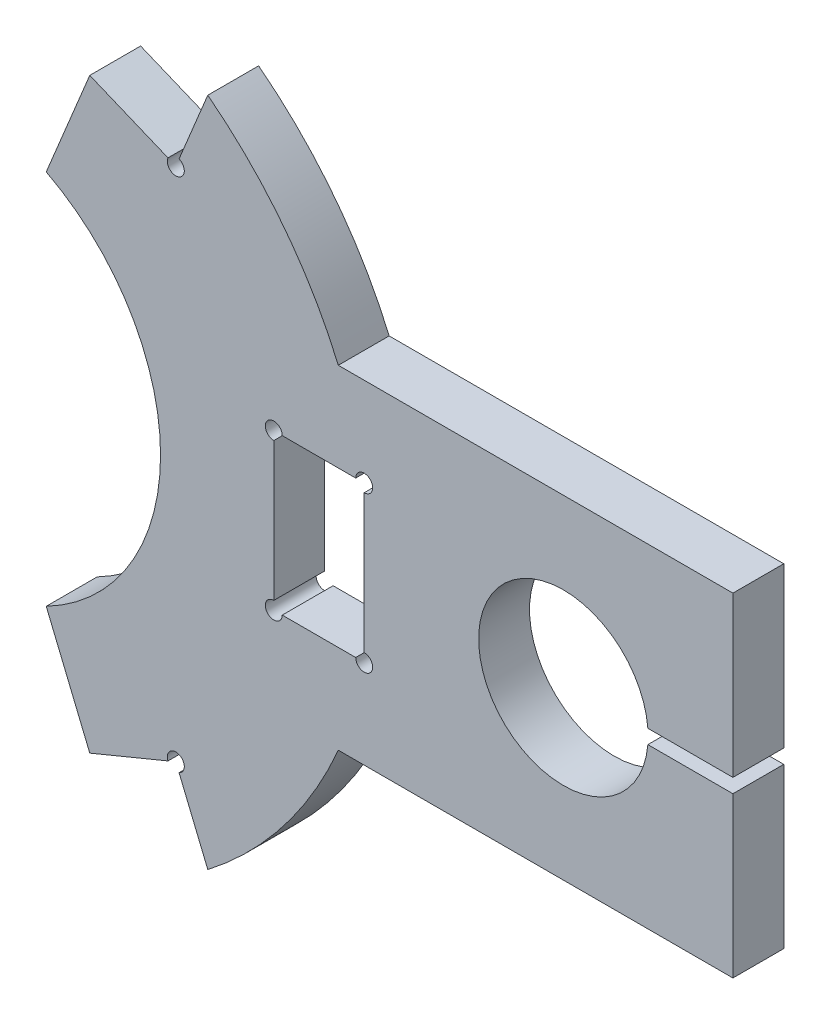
ISO-10303-21;
HEADER;
FILE_DESCRIPTION(('STEP AP214'),'2;1');
FILE_NAME('part.step','',(''),(''),'','','');
FILE_SCHEMA(('AUTOMOTIVE_DESIGN { 1 0 10303 214 1 1 1 1 }'));
ENDSEC;
DATA;
#1=APPLICATION_CONTEXT('core data for automotive mechanical design processes');
#2=APPLICATION_PROTOCOL_DEFINITION('international standard','automotive_design',2000,#1);
#3=PRODUCT_CONTEXT('',#1,'mechanical');
#4=PRODUCT('Part','Part','',(#3));
#5=PRODUCT_RELATED_PRODUCT_CATEGORY('part','',(#4));
#6=PRODUCT_DEFINITION_FORMATION('','',#4);
#7=PRODUCT_DEFINITION_CONTEXT('part definition',#1,'design');
#8=PRODUCT_DEFINITION('design','',#6,#7);
#9=PRODUCT_DEFINITION_SHAPE('','',#8);
#10=(LENGTH_UNIT() NAMED_UNIT(*) SI_UNIT(.MILLI.,.METRE.));
#11=(NAMED_UNIT(*) PLANE_ANGLE_UNIT() SI_UNIT($,.RADIAN.));
#12=(NAMED_UNIT(*) SI_UNIT($,.STERADIAN.) SOLID_ANGLE_UNIT());
#13=UNCERTAINTY_MEASURE_WITH_UNIT(LENGTH_MEASURE(1.E-05),#10,'distance_accuracy_value','');
#14=(GEOMETRIC_REPRESENTATION_CONTEXT(3) GLOBAL_UNCERTAINTY_ASSIGNED_CONTEXT((#13)) GLOBAL_UNIT_ASSIGNED_CONTEXT((#10,
#11,#12)) REPRESENTATION_CONTEXT('',''));
#15=CARTESIAN_POINT('',(0.,0.,0.));
#16=DIRECTION('',(0.,0.,1.));
#17=DIRECTION('',(1.,0.,0.));
#18=AXIS2_PLACEMENT_3D('',#15,#16,#17);
#19=CARTESIAN_POINT('',(276.692238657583,58.9900440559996,18.));
#20=DIRECTION('',(-1.,0.,0.));
#21=DIRECTION('',(0.,0.,1.));
#22=AXIS2_PLACEMENT_3D('',#19,#20,#21);
#23=PLANE('',#22);
#24=DIRECTION('',(0.,1.,0.));
#25=VECTOR('',#24,1.);
#26=CARTESIAN_POINT('',(276.692238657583,58.9900440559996,0.));
#27=LINE('',#26,#25);
#28=CARTESIAN_POINT('',(276.692238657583,-58.9900440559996,0.));
#29=VERTEX_POINT('',#28);
#30=CARTESIAN_POINT('',(276.692238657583,-2.50000000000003,0.));
#31=VERTEX_POINT('',#30);
#32=EDGE_CURVE('E335',#29,#31,#27,.T.);
#33=ORIENTED_EDGE('',*,*,#32,.T.);
#34=DIRECTION('',(0.,0.,-1.));
#35=VECTOR('',#34,1.);
#36=CARTESIAN_POINT('',(276.692238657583,-2.50000000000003,18.));
#37=LINE('',#36,#35);
#38=CARTESIAN_POINT('',(276.692238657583,-2.50000000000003,18.));
#39=VERTEX_POINT('',#38);
#40=EDGE_CURVE('E274',#39,#31,#37,.T.);
#41=ORIENTED_EDGE('',*,*,#40,.F.);
#42=DIRECTION('',(0.,1.,0.));
#43=VECTOR('',#42,1.);
#44=CARTESIAN_POINT('',(276.692238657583,58.9900440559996,18.));
#45=LINE('',#44,#43);
#46=CARTESIAN_POINT('',(276.692238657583,-58.9900440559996,18.));
#47=VERTEX_POINT('',#46);
#48=EDGE_CURVE('E306',#47,#39,#45,.T.);
#49=ORIENTED_EDGE('',*,*,#48,.F.);
#50=DIRECTION('',(0.,0.,-1.));
#51=VECTOR('',#50,1.);
#52=CARTESIAN_POINT('',(276.692238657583,-58.9900440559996,18.));
#53=LINE('',#52,#51);
#54=EDGE_CURVE('E344',#47,#29,#53,.T.);
#55=ORIENTED_EDGE('',*,*,#54,.T.);
#56=EDGE_LOOP('',(#33,#41,#49,#55));
#57=FACE_BOUND('',#56,.T.);
#58=ADVANCED_FACE('F37',(#57),#23,.F.);
#59=CARTESIAN_POINT('',(-0.894266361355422,0.,18.));
#60=DIRECTION('',(0.,0.,-1.));
#61=DIRECTION('',(-1.,0.,0.));
#62=AXIS2_PLACEMENT_3D('',#59,#60,#61);
#63=CYLINDRICAL_SURFACE('',#62,150.);
#64=CARTESIAN_POINT('',(-0.894266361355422,0.,0.));
#65=DIRECTION('',(0.,0.,1.));
#66=DIRECTION('',(1.,0.,0.));
#67=AXIS2_PLACEMENT_3D('',#64,#65,#66);
#68=CIRCLE('',#67,150.);
#69=CARTESIAN_POINT('',(137.019383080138,58.9900440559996,0.));
#70=VERTEX_POINT('',#69);
#71=CARTESIAN_POINT('',(90.8280302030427,118.68875394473,0.));
#72=VERTEX_POINT('',#71);
#73=EDGE_CURVE('E273',#70,#72,#68,.T.);
#74=ORIENTED_EDGE('',*,*,#73,.T.);
#75=DIRECTION('',(0.,0.,-1.));
#76=VECTOR('',#75,1.);
#77=CARTESIAN_POINT('',(90.8280302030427,118.68875394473,18.));
#78=LINE('',#77,#76);
#79=CARTESIAN_POINT('',(90.8280302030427,118.68875394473,18.));
#80=VERTEX_POINT('',#79);
#81=EDGE_CURVE('E365',#80,#72,#78,.T.);
#82=ORIENTED_EDGE('',*,*,#81,.F.);
#83=CARTESIAN_POINT('',(-0.894266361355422,0.,18.));
#84=DIRECTION('',(0.,0.,1.));
#85=DIRECTION('',(1.,0.,0.));
#86=AXIS2_PLACEMENT_3D('',#83,#84,#85);
#87=CIRCLE('',#86,150.);
#88=CARTESIAN_POINT('',(137.019383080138,58.9900440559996,18.));
#89=VERTEX_POINT('',#88);
#90=EDGE_CURVE('E281',#89,#80,#87,.T.);
#91=ORIENTED_EDGE('',*,*,#90,.F.);
#92=DIRECTION('',(0.,0.,-1.));
#93=VECTOR('',#92,1.);
#94=CARTESIAN_POINT('',(137.019383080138,58.9900440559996,18.));
#95=LINE('',#94,#93);
#96=EDGE_CURVE('E311',#89,#70,#95,.T.);
#97=ORIENTED_EDGE('',*,*,#96,.T.);
#98=EDGE_LOOP('',(#74,#82,#91,#97));
#99=FACE_BOUND('',#98,.T.);
#100=ADVANCED_FACE('F39',(#99),#63,.T.);
#101=CARTESIAN_POINT('',(90.8280302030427,118.68875394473,18.));
#102=DIRECTION('',(0.924241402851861,-0.381808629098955,0.));
#103=DIRECTION('',(0.381808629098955,0.924241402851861,0.));
#104=AXIS2_PLACEMENT_3D('',#101,#102,#103);
#105=PLANE('',#104);
#106=DIRECTION('',(-0.381808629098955,-0.924241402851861,0.));
#107=VECTOR('',#106,1.);
#108=CARTESIAN_POINT('',(90.8280302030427,118.68875394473,0.));
#109=LINE('',#108,#107);
#110=CARTESIAN_POINT('',(80.6558891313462,94.0651252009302,0.));
#111=VERTEX_POINT('',#110);
#112=EDGE_CURVE('E314',#72,#111,#109,.T.);
#113=ORIENTED_EDGE('',*,*,#112,.T.);
#114=DIRECTION('',(0.,0.,-1.));
#115=VECTOR('',#114,1.);
#116=CARTESIAN_POINT('',(80.6558891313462,94.0651252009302,18.));
#117=LINE('',#116,#115);
#118=CARTESIAN_POINT('',(80.6558891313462,94.0651252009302,18.));
#119=VERTEX_POINT('',#118);
#120=EDGE_CURVE('E237',#111,#119,#117,.F.);
#121=ORIENTED_EDGE('',*,*,#120,.T.);
#122=DIRECTION('',(-0.381808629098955,-0.924241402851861,0.));
#123=VECTOR('',#122,1.);
#124=CARTESIAN_POINT('',(90.8280302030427,118.68875394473,18.));
#125=LINE('',#124,#123);
#126=EDGE_CURVE('E284',#80,#119,#125,.T.);
#127=ORIENTED_EDGE('',*,*,#126,.F.);
#128=ORIENTED_EDGE('',*,*,#81,.T.);
#129=EDGE_LOOP('',(#113,#121,#127,#128));
#130=FACE_BOUND('',#129,.T.);
#131=ADVANCED_FACE('F449',(#130),#105,.F.);
#132=CARTESIAN_POINT('',(79.5104632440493,91.2924009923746,18.));
#133=DIRECTION('',(-0.381808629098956,-0.924241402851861,0.));
#134=DIRECTION('',(0.924241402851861,-0.381808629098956,0.));
#135=AXIS2_PLACEMENT_3D('',#132,#133,#134);
#136=PLANE('',#135);
#137=DIRECTION('',(-0.924241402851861,0.381808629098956,0.));
#138=VECTOR('',#137,1.);
#139=CARTESIAN_POINT('',(79.5104632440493,91.2924009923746,18.));
#140=LINE('',#139,#138);
#141=CARTESIAN_POINT('',(76.7377390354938,92.4378268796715,18.));
#142=VERTEX_POINT('',#141);
#143=CARTESIAN_POINT('',(49.0511597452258,103.87528775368,18.));
#144=VERTEX_POINT('',#143);
#145=EDGE_CURVE('E288',#142,#144,#140,.T.);
#146=ORIENTED_EDGE('',*,*,#145,.F.);
#147=DIRECTION('',(0.,0.,-1.));
#148=VECTOR('',#147,1.);
#149=CARTESIAN_POINT('',(76.7377390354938,92.4378268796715,18.));
#150=LINE('',#149,#148);
#151=CARTESIAN_POINT('',(76.7377390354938,92.4378268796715,0.));
#152=VERTEX_POINT('',#151);
#153=EDGE_CURVE('E242',#142,#152,#150,.T.);
#154=ORIENTED_EDGE('',*,*,#153,.T.);
#155=DIRECTION('',(-0.924241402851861,0.381808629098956,0.));
#156=VECTOR('',#155,1.);
#157=CARTESIAN_POINT('',(79.5104632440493,91.2924009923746,0.));
#158=LINE('',#157,#156);
#159=CARTESIAN_POINT('',(49.0511597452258,103.87528775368,0.));
#160=VERTEX_POINT('',#159);
#161=EDGE_CURVE('E317',#152,#160,#158,.T.);
#162=ORIENTED_EDGE('',*,*,#161,.T.);
#163=DIRECTION('',(0.,0.,-1.));
#164=VECTOR('',#163,1.);
#165=CARTESIAN_POINT('',(49.0511597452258,103.87528775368,18.));
#166=LINE('',#165,#164);
#167=EDGE_CURVE('E362',#144,#160,#166,.T.);
#168=ORIENTED_EDGE('',*,*,#167,.F.);
#169=EDGE_LOOP('',(#146,#154,#162,#168));
#170=FACE_BOUND('',#169,.T.);
#171=ADVANCED_FACE('F490',(#170),#136,.F.);
#172=CARTESIAN_POINT('',(49.0511597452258,103.87528775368,18.));
#173=DIRECTION('',(0.924241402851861,-0.381808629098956,0.));
#174=DIRECTION('',(0.381808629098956,0.924241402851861,0.));
#175=AXIS2_PLACEMENT_3D('',#172,#173,#174);
#176=PLANE('',#175);
#177=DIRECTION('',(-0.381808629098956,-0.924241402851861,0.));
#178=VECTOR('',#177,1.);
#179=CARTESIAN_POINT('',(49.0511597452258,103.87528775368,0.));
#180=LINE('',#179,#178);
#181=CARTESIAN_POINT('',(33.6422286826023,66.5749991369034,0.));
#182=VERTEX_POINT('',#181);
#183=EDGE_CURVE('E319',#160,#182,#180,.T.);
#184=ORIENTED_EDGE('',*,*,#183,.T.);
#185=DIRECTION('',(0.,0.,-1.));
#186=VECTOR('',#185,1.);
#187=CARTESIAN_POINT('',(33.6422286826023,66.5749991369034,18.));
#188=LINE('',#187,#186);
#189=CARTESIAN_POINT('',(33.6422286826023,66.5749991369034,18.));
#190=VERTEX_POINT('',#189);
#191=EDGE_CURVE('E359',#190,#182,#188,.T.);
#192=ORIENTED_EDGE('',*,*,#191,.F.);
#193=DIRECTION('',(-0.381808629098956,-0.924241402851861,0.));
#194=VECTOR('',#193,1.);
#195=CARTESIAN_POINT('',(49.0511597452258,103.87528775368,18.));
#196=LINE('',#195,#194);
#197=EDGE_CURVE('E290',#144,#190,#196,.T.);
#198=ORIENTED_EDGE('',*,*,#197,.F.);
#199=ORIENTED_EDGE('',*,*,#167,.T.);
#200=EDGE_LOOP('',(#184,#192,#198,#199));
#201=FACE_BOUND('',#200,.T.);
#202=ADVANCED_FACE('F493',(#201),#176,.F.);
#203=CARTESIAN_POINT('',(-0.894266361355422,0.,18.));
#204=DIRECTION('',(0.,0.,-1.));
#205=DIRECTION('',(-1.,0.,0.));
#206=AXIS2_PLACEMENT_3D('',#203,#204,#205);
#207=CYLINDRICAL_SURFACE('',#206,75.);
#208=CARTESIAN_POINT('',(-0.894266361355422,0.,0.));
#209=DIRECTION('',(0.,0.,-1.));
#210=DIRECTION('',(1.,0.,0.));
#211=AXIS2_PLACEMENT_3D('',#208,#209,#210);
#212=CIRCLE('',#211,75.);
#213=CARTESIAN_POINT('',(33.6422286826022,-66.5749991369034,0.));
#214=VERTEX_POINT('',#213);
#215=EDGE_CURVE('E321',#182,#214,#212,.T.);
#216=ORIENTED_EDGE('',*,*,#215,.T.);
#217=DIRECTION('',(0.,0.,-1.));
#218=VECTOR('',#217,1.);
#219=CARTESIAN_POINT('',(33.6422286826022,-66.5749991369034,18.));
#220=LINE('',#219,#218);
#221=CARTESIAN_POINT('',(33.6422286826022,-66.5749991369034,18.));
#222=VERTEX_POINT('',#221);
#223=EDGE_CURVE('E356',#222,#214,#220,.T.);
#224=ORIENTED_EDGE('',*,*,#223,.F.);
#225=CARTESIAN_POINT('',(-0.894266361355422,0.,18.));
#226=DIRECTION('',(0.,0.,-1.));
#227=DIRECTION('',(1.,0.,0.));
#228=AXIS2_PLACEMENT_3D('',#225,#226,#227);
#229=CIRCLE('',#228,75.);
#230=EDGE_CURVE('E292',#190,#222,#229,.T.);
#231=ORIENTED_EDGE('',*,*,#230,.F.);
#232=ORIENTED_EDGE('',*,*,#191,.T.);
#233=EDGE_LOOP('',(#216,#224,#231,#232));
#234=FACE_BOUND('',#233,.T.);
#235=ADVANCED_FACE('F500',(#234),#207,.F.);
#236=CARTESIAN_POINT('',(49.0511597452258,-103.87528775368,18.));
#237=DIRECTION('',(0.924241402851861,0.381808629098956,0.));
#238=DIRECTION('',(-0.381808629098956,0.924241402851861,0.));
#239=AXIS2_PLACEMENT_3D('',#236,#237,#238);
#240=PLANE('',#239);
#241=DIRECTION('',(0.381808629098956,-0.924241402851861,0.));
#242=VECTOR('',#241,1.);
#243=CARTESIAN_POINT('',(49.0511597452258,-103.87528775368,0.));
#244=LINE('',#243,#242);
#245=CARTESIAN_POINT('',(49.0511597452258,-103.87528775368,0.));
#246=VERTEX_POINT('',#245);
#247=EDGE_CURVE('E323',#214,#246,#244,.T.);
#248=ORIENTED_EDGE('',*,*,#247,.T.);
#249=DIRECTION('',(0.,0.,-1.));
#250=VECTOR('',#249,1.);
#251=CARTESIAN_POINT('',(49.0511597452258,-103.87528775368,18.));
#252=LINE('',#251,#250);
#253=CARTESIAN_POINT('',(49.0511597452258,-103.87528775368,18.));
#254=VERTEX_POINT('',#253);
#255=EDGE_CURVE('E353',#254,#246,#252,.T.);
#256=ORIENTED_EDGE('',*,*,#255,.F.);
#257=DIRECTION('',(0.381808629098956,-0.924241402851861,0.));
#258=VECTOR('',#257,1.);
#259=CARTESIAN_POINT('',(49.0511597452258,-103.87528775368,18.));
#260=LINE('',#259,#258);
#261=EDGE_CURVE('E294',#222,#254,#260,.T.);
#262=ORIENTED_EDGE('',*,*,#261,.F.);
#263=ORIENTED_EDGE('',*,*,#223,.T.);
#264=EDGE_LOOP('',(#248,#256,#262,#263));
#265=FACE_BOUND('',#264,.T.);
#266=ADVANCED_FACE('F503',(#265),#240,.F.);
#267=CARTESIAN_POINT('',(79.5104632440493,-91.2924009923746,18.));
#268=DIRECTION('',(-0.381808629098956,0.924241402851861,0.));
#269=DIRECTION('',(-0.924241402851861,-0.381808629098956,0.));
#270=AXIS2_PLACEMENT_3D('',#267,#268,#269);
#271=PLANE('',#270);
#272=DIRECTION('',(0.924241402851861,0.381808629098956,0.));
#273=VECTOR('',#272,1.);
#274=CARTESIAN_POINT('',(79.5104632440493,-91.2924009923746,0.));
#275=LINE('',#274,#273);
#276=CARTESIAN_POINT('',(76.7377390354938,-92.4378268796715,0.));
#277=VERTEX_POINT('',#276);
#278=EDGE_CURVE('E325',#246,#277,#275,.T.);
#279=ORIENTED_EDGE('',*,*,#278,.T.);
#280=DIRECTION('',(0.,0.,-1.));
#281=VECTOR('',#280,1.);
#282=CARTESIAN_POINT('',(76.7377390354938,-92.4378268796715,18.));
#283=LINE('',#282,#281);
#284=CARTESIAN_POINT('',(76.7377390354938,-92.4378268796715,18.));
#285=VERTEX_POINT('',#284);
#286=EDGE_CURVE('E52',#277,#285,#283,.F.);
#287=ORIENTED_EDGE('',*,*,#286,.T.);
#288=DIRECTION('',(0.924241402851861,0.381808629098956,0.));
#289=VECTOR('',#288,1.);
#290=CARTESIAN_POINT('',(79.5104632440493,-91.2924009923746,18.));
#291=LINE('',#290,#289);
#292=EDGE_CURVE('E296',#254,#285,#291,.T.);
#293=ORIENTED_EDGE('',*,*,#292,.F.);
#294=ORIENTED_EDGE('',*,*,#255,.T.);
#295=EDGE_LOOP('',(#279,#287,#293,#294));
#296=FACE_BOUND('',#295,.T.);
#297=ADVANCED_FACE('F507',(#296),#271,.F.);
#298=CARTESIAN_POINT('',(90.8280302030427,-118.68875394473,18.));
#299=DIRECTION('',(0.924241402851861,0.381808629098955,0.));
#300=DIRECTION('',(-0.381808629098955,0.924241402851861,0.));
#301=AXIS2_PLACEMENT_3D('',#298,#299,#300);
#302=PLANE('',#301);
#303=DIRECTION('',(0.381808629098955,-0.924241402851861,0.));
#304=VECTOR('',#303,1.);
#305=CARTESIAN_POINT('',(90.8280302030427,-118.68875394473,18.));
#306=LINE('',#305,#304);
#307=CARTESIAN_POINT('',(80.6558891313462,-94.0651252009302,18.));
#308=VERTEX_POINT('',#307);
#309=CARTESIAN_POINT('',(90.8280302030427,-118.68875394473,18.));
#310=VERTEX_POINT('',#309);
#311=EDGE_CURVE('E299',#308,#310,#306,.T.);
#312=ORIENTED_EDGE('',*,*,#311,.F.);
#313=DIRECTION('',(0.,0.,-1.));
#314=VECTOR('',#313,1.);
#315=CARTESIAN_POINT('',(80.6558891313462,-94.0651252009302,18.));
#316=LINE('',#315,#314);
#317=CARTESIAN_POINT('',(80.6558891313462,-94.0651252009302,0.));
#318=VERTEX_POINT('',#317);
#319=EDGE_CURVE('E404',#308,#318,#316,.T.);
#320=ORIENTED_EDGE('',*,*,#319,.T.);
#321=DIRECTION('',(0.381808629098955,-0.924241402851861,0.));
#322=VECTOR('',#321,1.);
#323=CARTESIAN_POINT('',(90.8280302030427,-118.68875394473,0.));
#324=LINE('',#323,#322);
#325=CARTESIAN_POINT('',(90.8280302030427,-118.68875394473,0.));
#326=VERTEX_POINT('',#325);
#327=EDGE_CURVE('E328',#318,#326,#324,.T.);
#328=ORIENTED_EDGE('',*,*,#327,.T.);
#329=DIRECTION('',(0.,0.,-1.));
#330=VECTOR('',#329,1.);
#331=CARTESIAN_POINT('',(90.8280302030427,-118.68875394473,18.));
#332=LINE('',#331,#330);
#333=EDGE_CURVE('E350',#310,#326,#332,.T.);
#334=ORIENTED_EDGE('',*,*,#333,.F.);
#335=EDGE_LOOP('',(#312,#320,#328,#334));
#336=FACE_BOUND('',#335,.T.);
#337=ADVANCED_FACE('F511',(#336),#302,.F.);
#338=CARTESIAN_POINT('',(-0.894266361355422,0.,18.));
#339=DIRECTION('',(0.,0.,-1.));
#340=DIRECTION('',(-1.,0.,0.));
#341=AXIS2_PLACEMENT_3D('',#338,#339,#340);
#342=CYLINDRICAL_SURFACE('',#341,150.);
#343=CARTESIAN_POINT('',(-0.894266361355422,0.,0.));
#344=DIRECTION('',(0.,0.,1.));
#345=DIRECTION('',(1.,0.,0.));
#346=AXIS2_PLACEMENT_3D('',#343,#344,#345);
#347=CIRCLE('',#346,150.);
#348=CARTESIAN_POINT('',(137.019383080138,-58.9900440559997,0.));
#349=VERTEX_POINT('',#348);
#350=EDGE_CURVE('E330',#326,#349,#347,.T.);
#351=ORIENTED_EDGE('',*,*,#350,.T.);
#352=DIRECTION('',(0.,0.,-1.));
#353=VECTOR('',#352,1.);
#354=CARTESIAN_POINT('',(137.019383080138,-58.9900440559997,18.));
#355=LINE('',#354,#353);
#356=CARTESIAN_POINT('',(137.019383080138,-58.9900440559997,18.));
#357=VERTEX_POINT('',#356);
#358=EDGE_CURVE('E347',#357,#349,#355,.T.);
#359=ORIENTED_EDGE('',*,*,#358,.F.);
#360=CARTESIAN_POINT('',(-0.894266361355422,0.,18.));
#361=DIRECTION('',(0.,0.,1.));
#362=DIRECTION('',(1.,0.,0.));
#363=AXIS2_PLACEMENT_3D('',#360,#361,#362);
#364=CIRCLE('',#363,150.);
#365=EDGE_CURVE('E301',#310,#357,#364,.T.);
#366=ORIENTED_EDGE('',*,*,#365,.F.);
#367=ORIENTED_EDGE('',*,*,#333,.T.);
#368=EDGE_LOOP('',(#351,#359,#366,#367));
#369=FACE_BOUND('',#368,.T.);
#370=ADVANCED_FACE('F462',(#369),#342,.T.);
#371=CARTESIAN_POINT('',(137.019383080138,-58.9900440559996,18.));
#372=DIRECTION('',(0.,1.,0.));
#373=DIRECTION('',(-1.,0.,0.));
#374=AXIS2_PLACEMENT_3D('',#371,#372,#373);
#375=PLANE('',#374);
#376=DIRECTION('',(1.,0.,0.));
#377=VECTOR('',#376,1.);
#378=CARTESIAN_POINT('',(137.019383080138,-58.9900440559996,0.));
#379=LINE('',#378,#377);
#380=EDGE_CURVE('E332',#349,#29,#379,.T.);
#381=ORIENTED_EDGE('',*,*,#380,.T.);
#382=ORIENTED_EDGE('',*,*,#54,.F.);
#383=DIRECTION('',(1.,0.,0.));
#384=VECTOR('',#383,1.);
#385=CARTESIAN_POINT('',(137.019383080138,-58.9900440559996,18.));
#386=LINE('',#385,#384);
#387=EDGE_CURVE('E303',#357,#47,#386,.T.);
#388=ORIENTED_EDGE('',*,*,#387,.F.);
#389=ORIENTED_EDGE('',*,*,#358,.T.);
#390=EDGE_LOOP('',(#381,#382,#388,#389));
#391=FACE_BOUND('',#390,.T.);
#392=ADVANCED_FACE('F455',(#391),#375,.F.);
#393=CARTESIAN_POINT('',(276.692238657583,2.49999999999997,18.));
#394=VERTEX_POINT('',#393);
#395=CARTESIAN_POINT('',(276.692238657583,58.9900440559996,18.));
#396=VERTEX_POINT('',#395);
#397=EDGE_CURVE('E305',#394,#396,#45,.T.);
#398=ORIENTED_EDGE('',*,*,#397,.F.);
#399=DIRECTION('',(0.,0.,-1.));
#400=VECTOR('',#399,1.);
#401=CARTESIAN_POINT('',(276.692238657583,2.49999999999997,18.));
#402=LINE('',#401,#400);
#403=CARTESIAN_POINT('',(276.692238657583,2.49999999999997,0.));
#404=VERTEX_POINT('',#403);
#405=EDGE_CURVE('E276',#394,#404,#402,.T.);
#406=ORIENTED_EDGE('',*,*,#405,.T.);
#407=CARTESIAN_POINT('',(276.692238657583,58.9900440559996,0.));
#408=VERTEX_POINT('',#407);
#409=EDGE_CURVE('E334',#404,#408,#27,.T.);
#410=ORIENTED_EDGE('',*,*,#409,.T.);
#411=DIRECTION('',(0.,0.,-1.));
#412=VECTOR('',#411,1.);
#413=CARTESIAN_POINT('',(276.692238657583,58.9900440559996,18.));
#414=LINE('',#413,#412);
#415=EDGE_CURVE('E341',#396,#408,#414,.T.);
#416=ORIENTED_EDGE('',*,*,#415,.F.);
#417=EDGE_LOOP('',(#398,#406,#410,#416));
#418=FACE_BOUND('',#417,.T.);
#419=ADVANCED_FACE('F445',(#418),#23,.F.);
#420=CARTESIAN_POINT('',(137.019383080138,58.9900440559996,18.));
#421=DIRECTION('',(0.,-1.,0.));
#422=DIRECTION('',(1.,0.,0.));
#423=AXIS2_PLACEMENT_3D('',#420,#421,#422);
#424=PLANE('',#423);
#425=DIRECTION('',(-1.,0.,0.));
#426=VECTOR('',#425,1.);
#427=CARTESIAN_POINT('',(137.019383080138,58.9900440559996,0.));
#428=LINE('',#427,#426);
#429=EDGE_CURVE('E285',#408,#70,#428,.T.);
#430=ORIENTED_EDGE('',*,*,#429,.T.);
#431=ORIENTED_EDGE('',*,*,#96,.F.);
#432=DIRECTION('',(-1.,0.,0.));
#433=VECTOR('',#432,1.);
#434=CARTESIAN_POINT('',(137.019383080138,58.9900440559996,18.));
#435=LINE('',#434,#433);
#436=EDGE_CURVE('E309',#396,#89,#435,.T.);
#437=ORIENTED_EDGE('',*,*,#436,.F.);
#438=ORIENTED_EDGE('',*,*,#415,.T.);
#439=EDGE_LOOP('',(#430,#431,#437,#438));
#440=FACE_BOUND('',#439,.T.);
#441=ADVANCED_FACE('F454',(#440),#424,.F.);
#442=CARTESIAN_POINT('',(-0.894266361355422,0.,18.));
#443=DIRECTION('',(0.,0.,1.));
#444=DIRECTION('',(1.,0.,0.));
#445=AXIS2_PLACEMENT_3D('',#442,#443,#444);
#446=PLANE('',#445);
#447=CARTESIAN_POINT('',(114.182655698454,27.5,18.));
#448=DIRECTION('',(0.,0.,-1.));
#449=DIRECTION('',(-1.,0.,0.));
#450=AXIS2_PLACEMENT_3D('',#447,#448,#449);
#451=CIRCLE('',#450,3.00000000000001);
#452=CARTESIAN_POINT('',(114.182655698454,24.5,18.));
#453=VERTEX_POINT('',#452);
#454=CARTESIAN_POINT('',(117.182655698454,27.5,18.));
#455=VERTEX_POINT('',#454);
#456=EDGE_CURVE('E220',#453,#455,#451,.T.);
#457=ORIENTED_EDGE('',*,*,#456,.T.);
#458=DIRECTION('',(1.,0.,0.));
#459=VECTOR('',#458,1.);
#460=CARTESIAN_POINT('',(146.182655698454,27.5,18.));
#461=LINE('',#460,#459);
#462=CARTESIAN_POINT('',(143.182655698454,27.5,18.));
#463=VERTEX_POINT('',#462);
#464=EDGE_CURVE('E391',#455,#463,#461,.T.);
#465=ORIENTED_EDGE('',*,*,#464,.T.);
#466=CARTESIAN_POINT('',(146.182655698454,27.5,18.));
#467=DIRECTION('',(0.,0.,-1.));
#468=DIRECTION('',(-1.,0.,0.));
#469=AXIS2_PLACEMENT_3D('',#466,#467,#468);
#470=CIRCLE('',#469,2.99999999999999);
#471=CARTESIAN_POINT('',(146.182655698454,24.5,18.));
#472=VERTEX_POINT('',#471);
#473=EDGE_CURVE('E390',#463,#472,#470,.T.);
#474=ORIENTED_EDGE('',*,*,#473,.T.);
#475=DIRECTION('',(0.,-1.,0.));
#476=VECTOR('',#475,1.);
#477=CARTESIAN_POINT('',(146.182655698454,-27.5,18.));
#478=LINE('',#477,#476);
#479=CARTESIAN_POINT('',(146.182655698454,-24.5,18.));
#480=VERTEX_POINT('',#479);
#481=EDGE_CURVE('E245',#472,#480,#478,.T.);
#482=ORIENTED_EDGE('',*,*,#481,.T.);
#483=CARTESIAN_POINT('',(146.182655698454,-27.5,18.));
#484=DIRECTION('',(0.,0.,-1.));
#485=DIRECTION('',(-1.,0.,0.));
#486=AXIS2_PLACEMENT_3D('',#483,#484,#485);
#487=CIRCLE('',#486,2.99999999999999);
#488=CARTESIAN_POINT('',(143.182655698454,-27.5,18.));
#489=VERTEX_POINT('',#488);
#490=EDGE_CURVE('E59',#480,#489,#487,.T.);
#491=ORIENTED_EDGE('',*,*,#490,.T.);
#492=DIRECTION('',(-1.,0.,0.));
#493=VECTOR('',#492,1.);
#494=CARTESIAN_POINT('',(114.182655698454,-27.5,18.));
#495=LINE('',#494,#493);
#496=CARTESIAN_POINT('',(117.182655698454,-27.5,18.));
#497=VERTEX_POINT('',#496);
#498=EDGE_CURVE('E253',#489,#497,#495,.T.);
#499=ORIENTED_EDGE('',*,*,#498,.T.);
#500=CARTESIAN_POINT('',(114.182655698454,-27.5,18.));
#501=DIRECTION('',(0.,0.,-1.));
#502=DIRECTION('',(-1.,0.,0.));
#503=AXIS2_PLACEMENT_3D('',#500,#501,#502);
#504=CIRCLE('',#503,3.00000000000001);
#505=CARTESIAN_POINT('',(114.182655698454,-24.5,18.));
#506=VERTEX_POINT('',#505);
#507=EDGE_CURVE('E214',#497,#506,#504,.T.);
#508=ORIENTED_EDGE('',*,*,#507,.T.);
#509=DIRECTION('',(0.,1.,0.));
#510=VECTOR('',#509,1.);
#511=CARTESIAN_POINT('',(114.182655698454,27.5,18.));
#512=LINE('',#511,#510);
#513=EDGE_CURVE('E392',#506,#453,#512,.T.);
#514=ORIENTED_EDGE('',*,*,#513,.T.);
#515=EDGE_LOOP('',(#457,#465,#474,#482,#491,#499,#508,#514));
#516=FACE_BOUND('',#515,.T.);
#517=CARTESIAN_POINT('',(79.5104632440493,-91.2924009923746,18.));
#518=DIRECTION('',(0.,0.,-1.));
#519=DIRECTION('',(-1.,0.,0.));
#520=AXIS2_PLACEMENT_3D('',#517,#518,#519);
#521=CIRCLE('',#520,3.00000000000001);
#522=EDGE_CURVE('E414',#285,#308,#521,.T.);
#523=ORIENTED_EDGE('',*,*,#522,.T.);
#524=ORIENTED_EDGE('',*,*,#311,.T.);
#525=ORIENTED_EDGE('',*,*,#365,.T.);
#526=ORIENTED_EDGE('',*,*,#387,.T.);
#527=ORIENTED_EDGE('',*,*,#48,.T.);
#528=DIRECTION('',(-1.,0.,0.));
#529=VECTOR('',#528,1.);
#530=CARTESIAN_POINT('',(246.587890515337,-2.50000000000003,18.));
#531=LINE('',#530,#529);
#532=CARTESIAN_POINT('',(246.587890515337,-2.50000000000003,18.));
#533=VERTEX_POINT('',#532);
#534=EDGE_CURVE('E261',#39,#533,#531,.T.);
#535=ORIENTED_EDGE('',*,*,#534,.T.);
#536=CARTESIAN_POINT('',(216.692238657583,0.,18.));
#537=DIRECTION('',(0.,0.,-1.));
#538=DIRECTION('',(-1.,0.,0.));
#539=AXIS2_PLACEMENT_3D('',#536,#537,#538);
#540=CIRCLE('',#539,30.);
#541=CARTESIAN_POINT('',(246.587890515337,2.49999999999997,18.));
#542=VERTEX_POINT('',#541);
#543=EDGE_CURVE('E254',#533,#542,#540,.T.);
#544=ORIENTED_EDGE('',*,*,#543,.T.);
#545=DIRECTION('',(1.,0.,0.));
#546=VECTOR('',#545,1.);
#547=CARTESIAN_POINT('',(246.587890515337,2.49999999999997,18.));
#548=LINE('',#547,#546);
#549=EDGE_CURVE('E257',#542,#394,#548,.T.);
#550=ORIENTED_EDGE('',*,*,#549,.T.);
#551=ORIENTED_EDGE('',*,*,#397,.T.);
#552=ORIENTED_EDGE('',*,*,#436,.T.);
#553=ORIENTED_EDGE('',*,*,#90,.T.);
#554=ORIENTED_EDGE('',*,*,#126,.T.);
#555=CARTESIAN_POINT('',(79.5104632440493,91.2924009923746,18.));
#556=DIRECTION('',(0.,0.,-1.));
#557=DIRECTION('',(-1.,0.,0.));
#558=AXIS2_PLACEMENT_3D('',#555,#556,#557);
#559=CIRCLE('',#558,3.00000000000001);
#560=EDGE_CURVE('E400',#119,#142,#559,.T.);
#561=ORIENTED_EDGE('',*,*,#560,.T.);
#562=ORIENTED_EDGE('',*,*,#145,.T.);
#563=ORIENTED_EDGE('',*,*,#197,.T.);
#564=ORIENTED_EDGE('',*,*,#230,.T.);
#565=ORIENTED_EDGE('',*,*,#261,.T.);
#566=ORIENTED_EDGE('',*,*,#292,.T.);
#567=EDGE_LOOP('',(#523,#524,#525,#526,#527,#535,#544,#550,#551,#552,#553,#554,#561,#562,#563,
#564,#565,#566));
#568=FACE_BOUND('',#567,.T.);
#569=ADVANCED_FACE('F387',(#516,#568),#446,.T.);
#570=CARTESIAN_POINT('',(-0.894266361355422,0.,0.));
#571=DIRECTION('',(0.,0.,1.));
#572=DIRECTION('',(1.,0.,0.));
#573=AXIS2_PLACEMENT_3D('',#570,#571,#572);
#574=PLANE('',#573);
#575=DIRECTION('',(1.,0.,0.));
#576=VECTOR('',#575,1.);
#577=CARTESIAN_POINT('',(146.182655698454,27.5,0.));
#578=LINE('',#577,#576);
#579=CARTESIAN_POINT('',(117.182655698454,27.5,0.));
#580=VERTEX_POINT('',#579);
#581=CARTESIAN_POINT('',(143.182655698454,27.5,0.));
#582=VERTEX_POINT('',#581);
#583=EDGE_CURVE('E239',#580,#582,#578,.T.);
#584=ORIENTED_EDGE('',*,*,#583,.F.);
#585=CARTESIAN_POINT('',(114.182655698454,27.5,0.));
#586=DIRECTION('',(0.,0.,-1.));
#587=DIRECTION('',(-1.,0.,0.));
#588=AXIS2_PLACEMENT_3D('',#585,#586,#587);
#589=CIRCLE('',#588,3.00000000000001);
#590=CARTESIAN_POINT('',(114.182655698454,24.5,0.));
#591=VERTEX_POINT('',#590);
#592=EDGE_CURVE('E422',#591,#580,#589,.T.);
#593=ORIENTED_EDGE('',*,*,#592,.F.);
#594=DIRECTION('',(0.,1.,0.));
#595=VECTOR('',#594,1.);
#596=CARTESIAN_POINT('',(114.182655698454,27.5,0.));
#597=LINE('',#596,#595);
#598=CARTESIAN_POINT('',(114.182655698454,-24.5,0.));
#599=VERTEX_POINT('',#598);
#600=EDGE_CURVE('E232',#599,#591,#597,.T.);
#601=ORIENTED_EDGE('',*,*,#600,.F.);
#602=CARTESIAN_POINT('',(114.182655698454,-27.5,0.));
#603=DIRECTION('',(0.,0.,-1.));
#604=DIRECTION('',(-1.,0.,0.));
#605=AXIS2_PLACEMENT_3D('',#602,#603,#604);
#606=CIRCLE('',#605,3.00000000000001);
#607=CARTESIAN_POINT('',(117.182655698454,-27.5,0.));
#608=VERTEX_POINT('',#607);
#609=EDGE_CURVE('E211',#608,#599,#606,.T.);
#610=ORIENTED_EDGE('',*,*,#609,.F.);
#611=DIRECTION('',(-1.,0.,0.));
#612=VECTOR('',#611,1.);
#613=CARTESIAN_POINT('',(114.182655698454,-27.5,0.));
#614=LINE('',#613,#612);
#615=CARTESIAN_POINT('',(143.182655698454,-27.5,0.));
#616=VERTEX_POINT('',#615);
#617=EDGE_CURVE('E229',#616,#608,#614,.T.);
#618=ORIENTED_EDGE('',*,*,#617,.F.);
#619=CARTESIAN_POINT('',(146.182655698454,-27.5,0.));
#620=DIRECTION('',(0.,0.,-1.));
#621=DIRECTION('',(-1.,0.,0.));
#622=AXIS2_PLACEMENT_3D('',#619,#620,#621);
#623=CIRCLE('',#622,2.99999999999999);
#624=CARTESIAN_POINT('',(146.182655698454,-24.5,0.));
#625=VERTEX_POINT('',#624);
#626=EDGE_CURVE('E417',#625,#616,#623,.T.);
#627=ORIENTED_EDGE('',*,*,#626,.F.);
#628=DIRECTION('',(0.,-1.,0.));
#629=VECTOR('',#628,1.);
#630=CARTESIAN_POINT('',(146.182655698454,-27.5,0.));
#631=LINE('',#630,#629);
#632=CARTESIAN_POINT('',(146.182655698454,24.5,0.));
#633=VERTEX_POINT('',#632);
#634=EDGE_CURVE('E250',#633,#625,#631,.T.);
#635=ORIENTED_EDGE('',*,*,#634,.F.);
#636=CARTESIAN_POINT('',(146.182655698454,27.5,0.));
#637=DIRECTION('',(0.,0.,-1.));
#638=DIRECTION('',(-1.,0.,0.));
#639=AXIS2_PLACEMENT_3D('',#636,#637,#638);
#640=CIRCLE('',#639,2.99999999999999);
#641=EDGE_CURVE('E413',#582,#633,#640,.T.);
#642=ORIENTED_EDGE('',*,*,#641,.F.);
#643=EDGE_LOOP('',(#584,#593,#601,#610,#618,#627,#635,#642));
#644=FACE_BOUND('',#643,.T.);
#645=ORIENTED_EDGE('',*,*,#327,.F.);
#646=CARTESIAN_POINT('',(79.5104632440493,-91.2924009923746,0.));
#647=DIRECTION('',(0.,0.,1.));
#648=DIRECTION('',(1.,0.,0.));
#649=AXIS2_PLACEMENT_3D('',#646,#647,#648);
#650=CIRCLE('',#649,3.00000000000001);
#651=EDGE_CURVE('E11',#318,#277,#650,.T.);
#652=ORIENTED_EDGE('',*,*,#651,.T.);
#653=ORIENTED_EDGE('',*,*,#278,.F.);
#654=ORIENTED_EDGE('',*,*,#247,.F.);
#655=ORIENTED_EDGE('',*,*,#215,.F.);
#656=ORIENTED_EDGE('',*,*,#183,.F.);
#657=ORIENTED_EDGE('',*,*,#161,.F.);
#658=CARTESIAN_POINT('',(79.5104632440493,91.2924009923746,0.));
#659=DIRECTION('',(0.,0.,1.));
#660=DIRECTION('',(1.,0.,0.));
#661=AXIS2_PLACEMENT_3D('',#658,#659,#660);
#662=CIRCLE('',#661,3.00000000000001);
#663=EDGE_CURVE('E368',#152,#111,#662,.T.);
#664=ORIENTED_EDGE('',*,*,#663,.T.);
#665=ORIENTED_EDGE('',*,*,#112,.F.);
#666=ORIENTED_EDGE('',*,*,#73,.F.);
#667=ORIENTED_EDGE('',*,*,#429,.F.);
#668=ORIENTED_EDGE('',*,*,#409,.F.);
#669=DIRECTION('',(1.,0.,0.));
#670=VECTOR('',#669,1.);
#671=CARTESIAN_POINT('',(246.587890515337,2.49999999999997,0.));
#672=LINE('',#671,#670);
#673=CARTESIAN_POINT('',(246.587890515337,2.49999999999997,0.));
#674=VERTEX_POINT('',#673);
#675=EDGE_CURVE('E267',#674,#404,#672,.T.);
#676=ORIENTED_EDGE('',*,*,#675,.F.);
#677=CARTESIAN_POINT('',(216.692238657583,0.,0.));
#678=DIRECTION('',(0.,0.,-1.));
#679=DIRECTION('',(-1.,0.,0.));
#680=AXIS2_PLACEMENT_3D('',#677,#678,#679);
#681=CIRCLE('',#680,30.);
#682=CARTESIAN_POINT('',(246.587890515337,-2.50000000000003,0.));
#683=VERTEX_POINT('',#682);
#684=EDGE_CURVE('E265',#683,#674,#681,.T.);
#685=ORIENTED_EDGE('',*,*,#684,.F.);
#686=DIRECTION('',(-1.,0.,0.));
#687=VECTOR('',#686,1.);
#688=CARTESIAN_POINT('',(246.587890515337,-2.50000000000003,0.));
#689=LINE('',#688,#687);
#690=EDGE_CURVE('E258',#31,#683,#689,.T.);
#691=ORIENTED_EDGE('',*,*,#690,.F.);
#692=ORIENTED_EDGE('',*,*,#32,.F.);
#693=ORIENTED_EDGE('',*,*,#380,.F.);
#694=ORIENTED_EDGE('',*,*,#350,.F.);
#695=EDGE_LOOP('',(#645,#652,#653,#654,#655,#656,#657,#664,#665,#666,#667,#668,#676,#685,#691,
#692,#693,#694));
#696=FACE_BOUND('',#695,.T.);
#697=ADVANCED_FACE('F226',(#644,#696),#574,.F.);
#698=CARTESIAN_POINT('',(216.692238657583,0.,18.));
#699=DIRECTION('',(0.,0.,-1.));
#700=DIRECTION('',(-1.,0.,0.));
#701=AXIS2_PLACEMENT_3D('',#698,#699,#700);
#702=CYLINDRICAL_SURFACE('',#701,30.);
#703=ORIENTED_EDGE('',*,*,#684,.T.);
#704=DIRECTION('',(0.,0.,-1.));
#705=VECTOR('',#704,1.);
#706=CARTESIAN_POINT('',(246.587890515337,2.49999999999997,18.));
#707=LINE('',#706,#705);
#708=EDGE_CURVE('E264',#542,#674,#707,.T.);
#709=ORIENTED_EDGE('',*,*,#708,.F.);
#710=ORIENTED_EDGE('',*,*,#543,.F.);
#711=DIRECTION('',(0.,0.,-1.));
#712=VECTOR('',#711,1.);
#713=CARTESIAN_POINT('',(246.587890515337,-2.50000000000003,18.));
#714=LINE('',#713,#712);
#715=EDGE_CURVE('E271',#533,#683,#714,.T.);
#716=ORIENTED_EDGE('',*,*,#715,.T.);
#717=EDGE_LOOP('',(#703,#709,#710,#716));
#718=FACE_BOUND('',#717,.T.);
#719=ADVANCED_FACE('F525',(#718),#702,.F.);
#720=CARTESIAN_POINT('',(246.587890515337,-2.50000000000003,18.));
#721=DIRECTION('',(0.,-1.,0.));
#722=DIRECTION('',(1.,0.,0.));
#723=AXIS2_PLACEMENT_3D('',#720,#721,#722);
#724=PLANE('',#723);
#725=ORIENTED_EDGE('',*,*,#690,.T.);
#726=ORIENTED_EDGE('',*,*,#715,.F.);
#727=ORIENTED_EDGE('',*,*,#534,.F.);
#728=ORIENTED_EDGE('',*,*,#40,.T.);
#729=EDGE_LOOP('',(#725,#726,#727,#728));
#730=FACE_BOUND('',#729,.T.);
#731=ADVANCED_FACE('F523',(#730),#724,.F.);
#732=CARTESIAN_POINT('',(246.587890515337,2.49999999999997,18.));
#733=DIRECTION('',(0.,1.,0.));
#734=DIRECTION('',(-1.,0.,0.));
#735=AXIS2_PLACEMENT_3D('',#732,#733,#734);
#736=PLANE('',#735);
#737=ORIENTED_EDGE('',*,*,#675,.T.);
#738=ORIENTED_EDGE('',*,*,#405,.F.);
#739=ORIENTED_EDGE('',*,*,#549,.F.);
#740=ORIENTED_EDGE('',*,*,#708,.T.);
#741=EDGE_LOOP('',(#737,#738,#739,#740));
#742=FACE_BOUND('',#741,.T.);
#743=ADVANCED_FACE('F472',(#742),#736,.F.);
#744=CARTESIAN_POINT('',(114.182655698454,-27.5,18.));
#745=DIRECTION('',(0.,-1.,0.));
#746=DIRECTION('',(1.,0.,0.));
#747=AXIS2_PLACEMENT_3D('',#744,#745,#746);
#748=PLANE('',#747);
#749=ORIENTED_EDGE('',*,*,#498,.F.);
#750=DIRECTION('',(0.,0.,-1.));
#751=VECTOR('',#750,1.);
#752=CARTESIAN_POINT('',(143.182655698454,-27.5,18.));
#753=LINE('',#752,#751);
#754=EDGE_CURVE('E236',#489,#616,#753,.T.);
#755=ORIENTED_EDGE('',*,*,#754,.T.);
#756=ORIENTED_EDGE('',*,*,#617,.T.);
#757=DIRECTION('',(0.,0.,-1.));
#758=VECTOR('',#757,1.);
#759=CARTESIAN_POINT('',(117.182655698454,-27.5,18.));
#760=LINE('',#759,#758);
#761=EDGE_CURVE('E208',#608,#497,#760,.F.);
#762=ORIENTED_EDGE('',*,*,#761,.T.);
#763=EDGE_LOOP('',(#749,#755,#756,#762));
#764=FACE_BOUND('',#763,.T.);
#765=ADVANCED_FACE('F235',(#764),#748,.F.);
#766=CARTESIAN_POINT('',(146.182655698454,-27.5,18.));
#767=DIRECTION('',(1.,0.,0.));
#768=DIRECTION('',(0.,1.,0.));
#769=AXIS2_PLACEMENT_3D('',#766,#767,#768);
#770=PLANE('',#769);
#771=ORIENTED_EDGE('',*,*,#481,.F.);
#772=DIRECTION('',(0.,0.,-1.));
#773=VECTOR('',#772,1.);
#774=CARTESIAN_POINT('',(146.182655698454,24.5,18.));
#775=LINE('',#774,#773);
#776=EDGE_CURVE('E408',#472,#633,#775,.T.);
#777=ORIENTED_EDGE('',*,*,#776,.T.);
#778=ORIENTED_EDGE('',*,*,#634,.T.);
#779=DIRECTION('',(0.,0.,-1.));
#780=VECTOR('',#779,1.);
#781=CARTESIAN_POINT('',(146.182655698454,-24.5,18.));
#782=LINE('',#781,#780);
#783=EDGE_CURVE('E45',#625,#480,#782,.F.);
#784=ORIENTED_EDGE('',*,*,#783,.T.);
#785=EDGE_LOOP('',(#771,#777,#778,#784));
#786=FACE_BOUND('',#785,.T.);
#787=ADVANCED_FACE('F381',(#786),#770,.F.);
#788=CARTESIAN_POINT('',(146.182655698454,27.5,18.));
#789=DIRECTION('',(0.,1.,0.));
#790=DIRECTION('',(-1.,0.,0.));
#791=AXIS2_PLACEMENT_3D('',#788,#789,#790);
#792=PLANE('',#791);
#793=ORIENTED_EDGE('',*,*,#464,.F.);
#794=DIRECTION('',(0.,0.,-1.));
#795=VECTOR('',#794,1.);
#796=CARTESIAN_POINT('',(117.182655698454,27.5,18.));
#797=LINE('',#796,#795);
#798=EDGE_CURVE('E219',#455,#580,#797,.T.);
#799=ORIENTED_EDGE('',*,*,#798,.T.);
#800=ORIENTED_EDGE('',*,*,#583,.T.);
#801=DIRECTION('',(0.,0.,-1.));
#802=VECTOR('',#801,1.);
#803=CARTESIAN_POINT('',(143.182655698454,27.5,18.));
#804=LINE('',#803,#802);
#805=EDGE_CURVE('E376',#582,#463,#804,.F.);
#806=ORIENTED_EDGE('',*,*,#805,.T.);
#807=EDGE_LOOP('',(#793,#799,#800,#806));
#808=FACE_BOUND('',#807,.T.);
#809=ADVANCED_FACE('F427',(#808),#792,.F.);
#810=CARTESIAN_POINT('',(114.182655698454,27.5,18.));
#811=DIRECTION('',(-1.,0.,0.));
#812=DIRECTION('',(0.,0.,1.));
#813=AXIS2_PLACEMENT_3D('',#810,#811,#812);
#814=PLANE('',#813);
#815=ORIENTED_EDGE('',*,*,#600,.T.);
#816=DIRECTION('',(0.,0.,-1.));
#817=VECTOR('',#816,1.);
#818=CARTESIAN_POINT('',(114.182655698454,24.5,18.));
#819=LINE('',#818,#817);
#820=EDGE_CURVE('E373',#591,#453,#819,.F.);
#821=ORIENTED_EDGE('',*,*,#820,.T.);
#822=ORIENTED_EDGE('',*,*,#513,.F.);
#823=DIRECTION('',(0.,0.,-1.));
#824=VECTOR('',#823,1.);
#825=CARTESIAN_POINT('',(114.182655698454,-24.5,18.));
#826=LINE('',#825,#824);
#827=EDGE_CURVE('E371',#506,#599,#826,.T.);
#828=ORIENTED_EDGE('',*,*,#827,.T.);
#829=EDGE_LOOP('',(#815,#821,#822,#828));
#830=FACE_BOUND('',#829,.T.);
#831=ADVANCED_FACE('F574',(#830),#814,.F.);
#832=CARTESIAN_POINT('',(79.5104632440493,91.2924009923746,18.));
#833=DIRECTION('',(0.,0.,-1.));
#834=DIRECTION('',(-1.,0.,0.));
#835=AXIS2_PLACEMENT_3D('',#832,#833,#834);
#836=CYLINDRICAL_SURFACE('',#835,3.00000000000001);
#837=ORIENTED_EDGE('',*,*,#663,.F.);
#838=ORIENTED_EDGE('',*,*,#153,.F.);
#839=ORIENTED_EDGE('',*,*,#560,.F.);
#840=ORIENTED_EDGE('',*,*,#120,.F.);
#841=EDGE_LOOP('',(#837,#838,#839,#840));
#842=FACE_BOUND('',#841,.T.);
#843=ADVANCED_FACE('F484',(#842),#836,.F.);
#844=CARTESIAN_POINT('',(114.182655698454,-27.5,18.));
#845=DIRECTION('',(0.,0.,-1.));
#846=DIRECTION('',(-1.,0.,0.));
#847=AXIS2_PLACEMENT_3D('',#844,#845,#846);
#848=CYLINDRICAL_SURFACE('',#847,3.00000000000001);
#849=ORIENTED_EDGE('',*,*,#609,.T.);
#850=ORIENTED_EDGE('',*,*,#827,.F.);
#851=ORIENTED_EDGE('',*,*,#507,.F.);
#852=ORIENTED_EDGE('',*,*,#761,.F.);
#853=EDGE_LOOP('',(#849,#850,#851,#852));
#854=FACE_BOUND('',#853,.T.);
#855=ADVANCED_FACE('F210',(#854),#848,.F.);
#856=CARTESIAN_POINT('',(114.182655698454,27.5,18.));
#857=DIRECTION('',(0.,0.,-1.));
#858=DIRECTION('',(-1.,0.,0.));
#859=AXIS2_PLACEMENT_3D('',#856,#857,#858);
#860=CYLINDRICAL_SURFACE('',#859,3.00000000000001);
#861=ORIENTED_EDGE('',*,*,#456,.F.);
#862=ORIENTED_EDGE('',*,*,#820,.F.);
#863=ORIENTED_EDGE('',*,*,#592,.T.);
#864=ORIENTED_EDGE('',*,*,#798,.F.);
#865=EDGE_LOOP('',(#861,#862,#863,#864));
#866=FACE_BOUND('',#865,.T.);
#867=ADVANCED_FACE('F440',(#866),#860,.F.);
#868=CARTESIAN_POINT('',(146.182655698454,27.5,18.));
#869=DIRECTION('',(0.,0.,-1.));
#870=DIRECTION('',(-1.,0.,0.));
#871=AXIS2_PLACEMENT_3D('',#868,#869,#870);
#872=CYLINDRICAL_SURFACE('',#871,2.99999999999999);
#873=ORIENTED_EDGE('',*,*,#473,.F.);
#874=ORIENTED_EDGE('',*,*,#805,.F.);
#875=ORIENTED_EDGE('',*,*,#641,.T.);
#876=ORIENTED_EDGE('',*,*,#776,.F.);
#877=EDGE_LOOP('',(#873,#874,#875,#876));
#878=FACE_BOUND('',#877,.T.);
#879=ADVANCED_FACE('F430',(#878),#872,.F.);
#880=CARTESIAN_POINT('',(146.182655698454,-27.5,18.));
#881=DIRECTION('',(0.,0.,-1.));
#882=DIRECTION('',(-1.,0.,0.));
#883=AXIS2_PLACEMENT_3D('',#880,#881,#882);
#884=CYLINDRICAL_SURFACE('',#883,2.99999999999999);
#885=ORIENTED_EDGE('',*,*,#490,.F.);
#886=ORIENTED_EDGE('',*,*,#783,.F.);
#887=ORIENTED_EDGE('',*,*,#626,.T.);
#888=ORIENTED_EDGE('',*,*,#754,.F.);
#889=EDGE_LOOP('',(#885,#886,#887,#888));
#890=FACE_BOUND('',#889,.T.);
#891=ADVANCED_FACE('F431',(#890),#884,.F.);
#892=CARTESIAN_POINT('',(79.5104632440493,-91.2924009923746,18.));
#893=DIRECTION('',(0.,0.,-1.));
#894=DIRECTION('',(-1.,0.,0.));
#895=AXIS2_PLACEMENT_3D('',#892,#893,#894);
#896=CYLINDRICAL_SURFACE('',#895,3.00000000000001);
#897=ORIENTED_EDGE('',*,*,#651,.F.);
#898=ORIENTED_EDGE('',*,*,#319,.F.);
#899=ORIENTED_EDGE('',*,*,#522,.F.);
#900=ORIENTED_EDGE('',*,*,#286,.F.);
#901=EDGE_LOOP('',(#897,#898,#899,#900));
#902=FACE_BOUND('',#901,.T.);
#903=ADVANCED_FACE('F433',(#902),#896,.F.);
#904=CLOSED_SHELL('',(#58,#100,#131,#171,#202,#235,#266,#297,#337,#370,#392,#419,#441,#569,#697,
#719,#731,#743,#765,#787,#809,#831,#843,#855,#867,#879,#891,#903));
#905=MANIFOLD_SOLID_BREP('B2',#904);
#906=ADVANCED_BREP_SHAPE_REPRESENTATION('',(#18,#905),#14);
#907=SHAPE_DEFINITION_REPRESENTATION(#9,#906);
ENDSEC;
END-ISO-10303-21;
